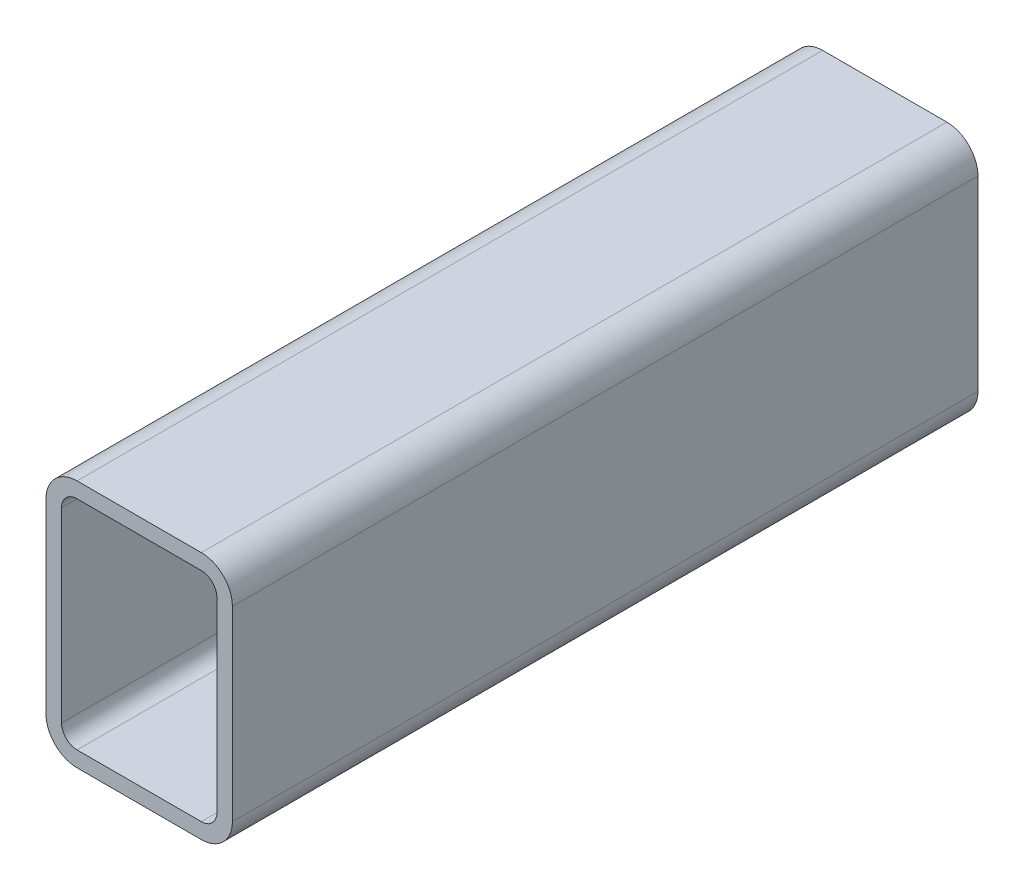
ISO-10303-21;
HEADER;
FILE_DESCRIPTION(('STEP AP214'),'2;1');
FILE_NAME('part.step','',(''),(''),'','','');
FILE_SCHEMA(('AUTOMOTIVE_DESIGN { 1 0 10303 214 1 1 1 1 }'));
ENDSEC;
DATA;
#1=APPLICATION_CONTEXT('core data for automotive mechanical design processes');
#2=APPLICATION_PROTOCOL_DEFINITION('international standard','automotive_design',2000,#1);
#3=PRODUCT_CONTEXT('',#1,'mechanical');
#4=PRODUCT('Part','Part','',(#3));
#5=PRODUCT_RELATED_PRODUCT_CATEGORY('part','',(#4));
#6=PRODUCT_DEFINITION_FORMATION('','',#4);
#7=PRODUCT_DEFINITION_CONTEXT('part definition',#1,'design');
#8=PRODUCT_DEFINITION('design','',#6,#7);
#9=PRODUCT_DEFINITION_SHAPE('','',#8);
#10=(LENGTH_UNIT() NAMED_UNIT(*) SI_UNIT(.MILLI.,.METRE.));
#11=(NAMED_UNIT(*) PLANE_ANGLE_UNIT() SI_UNIT($,.RADIAN.));
#12=(NAMED_UNIT(*) SI_UNIT($,.STERADIAN.) SOLID_ANGLE_UNIT());
#13=UNCERTAINTY_MEASURE_WITH_UNIT(LENGTH_MEASURE(1.E-05),#10,'distance_accuracy_value','');
#14=(GEOMETRIC_REPRESENTATION_CONTEXT(3) GLOBAL_UNCERTAINTY_ASSIGNED_CONTEXT((#13)) GLOBAL_UNIT_ASSIGNED_CONTEXT((#10,
#11,#12)) REPRESENTATION_CONTEXT('',''));
#15=CARTESIAN_POINT('',(0.,0.,0.));
#16=DIRECTION('',(0.,0.,1.));
#17=DIRECTION('',(1.,0.,0.));
#18=AXIS2_PLACEMENT_3D('',#15,#16,#17);
#19=CARTESIAN_POINT('',(15.1891160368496,90.9577651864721,304.8));
#20=DIRECTION('',(0.,0.,1.));
#21=DIRECTION('',(1.,0.,0.));
#22=AXIS2_PLACEMENT_3D('',#19,#20,#21);
#23=PLANE('',#22);
#24=CARTESIAN_POINT('',(15.1891160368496,90.9577651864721,304.8));
#25=DIRECTION('',(0.,0.,1.));
#26=DIRECTION('',(1.,0.,0.));
#27=AXIS2_PLACEMENT_3D('',#24,#25,#26);
#28=CIRCLE('',#27,12.7);
#29=CARTESIAN_POINT('',(15.1891160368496,103.657765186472,304.8));
#30=VERTEX_POINT('',#29);
#31=CARTESIAN_POINT('',(2.48911603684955,90.9577651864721,304.8));
#32=VERTEX_POINT('',#31);
#33=EDGE_CURVE('E211',#30,#32,#28,.T.);
#34=ORIENTED_EDGE('',*,*,#33,.T.);
#35=DIRECTION('',(0.,-1.,0.));
#36=VECTOR('',#35,1.);
#37=CARTESIAN_POINT('',(2.48911603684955,90.9577651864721,304.8));
#38=LINE('',#37,#36);
#39=CARTESIAN_POINT('',(2.48911603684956,14.7577651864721,304.8));
#40=VERTEX_POINT('',#39);
#41=EDGE_CURVE('E214',#32,#40,#38,.T.);
#42=ORIENTED_EDGE('',*,*,#41,.T.);
#43=CARTESIAN_POINT('',(15.1891160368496,14.7577651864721,304.8));
#44=DIRECTION('',(0.,0.,1.));
#45=DIRECTION('',(1.,0.,0.));
#46=AXIS2_PLACEMENT_3D('',#43,#44,#45);
#47=CIRCLE('',#46,12.7);
#48=CARTESIAN_POINT('',(15.1891160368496,2.05776518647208,304.8));
#49=VERTEX_POINT('',#48);
#50=EDGE_CURVE('E217',#40,#49,#47,.T.);
#51=ORIENTED_EDGE('',*,*,#50,.T.);
#52=DIRECTION('',(1.,0.,0.));
#53=VECTOR('',#52,1.);
#54=CARTESIAN_POINT('',(15.1891160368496,2.05776518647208,304.8));
#55=LINE('',#54,#53);
#56=CARTESIAN_POINT('',(65.9891160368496,2.05776518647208,304.8));
#57=VERTEX_POINT('',#56);
#58=EDGE_CURVE('E219',#49,#57,#55,.T.);
#59=ORIENTED_EDGE('',*,*,#58,.T.);
#60=CARTESIAN_POINT('',(65.9891160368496,14.7577651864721,304.8));
#61=DIRECTION('',(0.,0.,1.));
#62=DIRECTION('',(1.,0.,0.));
#63=AXIS2_PLACEMENT_3D('',#60,#61,#62);
#64=CIRCLE('',#63,12.7);
#65=CARTESIAN_POINT('',(78.6891160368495,14.7577651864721,304.8));
#66=VERTEX_POINT('',#65);
#67=EDGE_CURVE('E221',#57,#66,#64,.T.);
#68=ORIENTED_EDGE('',*,*,#67,.T.);
#69=DIRECTION('',(0.,1.,0.));
#70=VECTOR('',#69,1.);
#71=CARTESIAN_POINT('',(78.6891160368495,14.7577651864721,304.8));
#72=LINE('',#71,#70);
#73=CARTESIAN_POINT('',(78.6891160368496,90.9577651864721,304.8));
#74=VERTEX_POINT('',#73);
#75=EDGE_CURVE('E223',#66,#74,#72,.T.);
#76=ORIENTED_EDGE('',*,*,#75,.T.);
#77=CARTESIAN_POINT('',(65.9891160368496,90.9577651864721,304.8));
#78=DIRECTION('',(0.,0.,1.));
#79=DIRECTION('',(1.,0.,0.));
#80=AXIS2_PLACEMENT_3D('',#77,#78,#79);
#81=CIRCLE('',#80,12.7);
#82=CARTESIAN_POINT('',(65.9891160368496,103.657765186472,304.8));
#83=VERTEX_POINT('',#82);
#84=EDGE_CURVE('E225',#74,#83,#81,.T.);
#85=ORIENTED_EDGE('',*,*,#84,.T.);
#86=DIRECTION('',(-1.,0.,0.));
#87=VECTOR('',#86,1.);
#88=CARTESIAN_POINT('',(65.9891160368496,103.657765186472,304.8));
#89=LINE('',#88,#87);
#90=EDGE_CURVE('E227',#83,#30,#89,.T.);
#91=ORIENTED_EDGE('',*,*,#90,.T.);
#92=EDGE_LOOP('',(#34,#42,#51,#59,#68,#76,#85,#91));
#93=FACE_BOUND('',#92,.T.);
#94=DIRECTION('',(0.,-1.,0.));
#95=VECTOR('',#94,1.);
#96=CARTESIAN_POINT('',(8.83911603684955,14.7577651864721,304.8));
#97=LINE('',#96,#95);
#98=CARTESIAN_POINT('',(8.83911603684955,90.9577651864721,304.8));
#99=VERTEX_POINT('',#98);
#100=CARTESIAN_POINT('',(8.83911603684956,14.7577651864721,304.8));
#101=VERTEX_POINT('',#100);
#102=EDGE_CURVE('E154',#99,#101,#97,.T.);
#103=ORIENTED_EDGE('',*,*,#102,.F.);
#104=CARTESIAN_POINT('',(15.1891160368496,90.9577651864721,304.8));
#105=DIRECTION('',(0.,0.,1.));
#106=DIRECTION('',(1.,0.,0.));
#107=AXIS2_PLACEMENT_3D('',#104,#105,#106);
#108=CIRCLE('',#107,6.35000000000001);
#109=CARTESIAN_POINT('',(15.1891160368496,97.3077651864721,304.8));
#110=VERTEX_POINT('',#109);
#111=EDGE_CURVE('E146',#110,#99,#108,.T.);
#112=ORIENTED_EDGE('',*,*,#111,.F.);
#113=DIRECTION('',(-1.,0.,0.));
#114=VECTOR('',#113,1.);
#115=CARTESIAN_POINT('',(15.1891160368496,97.3077651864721,304.8));
#116=LINE('',#115,#114);
#117=CARTESIAN_POINT('',(65.9891160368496,97.3077651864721,304.8));
#118=VERTEX_POINT('',#117);
#119=EDGE_CURVE('E179',#118,#110,#116,.T.);
#120=ORIENTED_EDGE('',*,*,#119,.F.);
#121=CARTESIAN_POINT('',(65.9891160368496,90.9577651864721,304.8));
#122=DIRECTION('',(0.,0.,1.));
#123=DIRECTION('',(1.,0.,0.));
#124=AXIS2_PLACEMENT_3D('',#121,#122,#123);
#125=CIRCLE('',#124,6.35);
#126=CARTESIAN_POINT('',(72.3391160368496,90.9577651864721,304.8));
#127=VERTEX_POINT('',#126);
#128=EDGE_CURVE('E177',#127,#118,#125,.T.);
#129=ORIENTED_EDGE('',*,*,#128,.F.);
#130=DIRECTION('',(0.,1.,0.));
#131=VECTOR('',#130,1.);
#132=CARTESIAN_POINT('',(72.3391160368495,90.9577651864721,304.8));
#133=LINE('',#132,#131);
#134=CARTESIAN_POINT('',(72.3391160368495,14.7577651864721,304.8));
#135=VERTEX_POINT('',#134);
#136=EDGE_CURVE('E175',#135,#127,#133,.T.);
#137=ORIENTED_EDGE('',*,*,#136,.F.);
#138=CARTESIAN_POINT('',(65.9891160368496,14.7577651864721,304.8));
#139=DIRECTION('',(0.,0.,1.));
#140=DIRECTION('',(1.,0.,0.));
#141=AXIS2_PLACEMENT_3D('',#138,#139,#140);
#142=CIRCLE('',#141,6.35);
#143=CARTESIAN_POINT('',(65.9891160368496,8.40776518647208,304.8));
#144=VERTEX_POINT('',#143);
#145=EDGE_CURVE('E173',#144,#135,#142,.T.);
#146=ORIENTED_EDGE('',*,*,#145,.F.);
#147=DIRECTION('',(1.,0.,0.));
#148=VECTOR('',#147,1.);
#149=CARTESIAN_POINT('',(65.9891160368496,8.40776518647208,304.8));
#150=LINE('',#149,#148);
#151=CARTESIAN_POINT('',(15.1891160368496,8.40776518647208,304.8));
#152=VERTEX_POINT('',#151);
#153=EDGE_CURVE('E169',#152,#144,#150,.T.);
#154=ORIENTED_EDGE('',*,*,#153,.F.);
#155=CARTESIAN_POINT('',(15.1891160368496,14.7577651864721,304.8));
#156=DIRECTION('',(0.,0.,1.));
#157=DIRECTION('',(1.,0.,0.));
#158=AXIS2_PLACEMENT_3D('',#155,#156,#157);
#159=CIRCLE('',#158,6.35);
#160=EDGE_CURVE('E167',#101,#152,#159,.T.);
#161=ORIENTED_EDGE('',*,*,#160,.F.);
#162=EDGE_LOOP('',(#103,#112,#120,#129,#137,#146,#154,#161));
#163=FACE_BOUND('',#162,.T.);
#164=ADVANCED_FACE('F33',(#93,#163),#23,.T.);
#165=CARTESIAN_POINT('',(15.1891160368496,90.9577651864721,0.));
#166=DIRECTION('',(0.,0.,1.));
#167=DIRECTION('',(1.,0.,0.));
#168=AXIS2_PLACEMENT_3D('',#165,#166,#167);
#169=PLANE('',#168);
#170=CARTESIAN_POINT('',(15.1891160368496,90.9577651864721,0.));
#171=DIRECTION('',(0.,0.,1.));
#172=DIRECTION('',(1.,0.,0.));
#173=AXIS2_PLACEMENT_3D('',#170,#171,#172);
#174=CIRCLE('',#173,12.7);
#175=CARTESIAN_POINT('',(15.1891160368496,103.657765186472,0.));
#176=VERTEX_POINT('',#175);
#177=CARTESIAN_POINT('',(2.48911603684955,90.9577651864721,0.));
#178=VERTEX_POINT('',#177);
#179=EDGE_CURVE('E162',#176,#178,#174,.T.);
#180=ORIENTED_EDGE('',*,*,#179,.F.);
#181=DIRECTION('',(-1.,0.,0.));
#182=VECTOR('',#181,1.);
#183=CARTESIAN_POINT('',(65.9891160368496,103.657765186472,0.));
#184=LINE('',#183,#182);
#185=CARTESIAN_POINT('',(65.9891160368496,103.657765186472,0.));
#186=VERTEX_POINT('',#185);
#187=EDGE_CURVE('E215',#186,#176,#184,.T.);
#188=ORIENTED_EDGE('',*,*,#187,.F.);
#189=CARTESIAN_POINT('',(65.9891160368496,90.9577651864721,0.));
#190=DIRECTION('',(0.,0.,1.));
#191=DIRECTION('',(1.,0.,0.));
#192=AXIS2_PLACEMENT_3D('',#189,#190,#191);
#193=CIRCLE('',#192,12.7);
#194=CARTESIAN_POINT('',(78.6891160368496,90.9577651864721,0.));
#195=VERTEX_POINT('',#194);
#196=EDGE_CURVE('E242',#195,#186,#193,.T.);
#197=ORIENTED_EDGE('',*,*,#196,.F.);
#198=DIRECTION('',(0.,1.,0.));
#199=VECTOR('',#198,1.);
#200=CARTESIAN_POINT('',(78.6891160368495,14.7577651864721,0.));
#201=LINE('',#200,#199);
#202=CARTESIAN_POINT('',(78.6891160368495,14.7577651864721,0.));
#203=VERTEX_POINT('',#202);
#204=EDGE_CURVE('E240',#203,#195,#201,.T.);
#205=ORIENTED_EDGE('',*,*,#204,.F.);
#206=CARTESIAN_POINT('',(65.9891160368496,14.7577651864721,0.));
#207=DIRECTION('',(0.,0.,1.));
#208=DIRECTION('',(1.,0.,0.));
#209=AXIS2_PLACEMENT_3D('',#206,#207,#208);
#210=CIRCLE('',#209,12.7);
#211=CARTESIAN_POINT('',(65.9891160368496,2.05776518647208,0.));
#212=VERTEX_POINT('',#211);
#213=EDGE_CURVE('E238',#212,#203,#210,.T.);
#214=ORIENTED_EDGE('',*,*,#213,.F.);
#215=DIRECTION('',(1.,0.,0.));
#216=VECTOR('',#215,1.);
#217=CARTESIAN_POINT('',(15.1891160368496,2.05776518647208,0.));
#218=LINE('',#217,#216);
#219=CARTESIAN_POINT('',(15.1891160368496,2.05776518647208,0.));
#220=VERTEX_POINT('',#219);
#221=EDGE_CURVE('E236',#220,#212,#218,.T.);
#222=ORIENTED_EDGE('',*,*,#221,.F.);
#223=CARTESIAN_POINT('',(15.1891160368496,14.7577651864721,0.));
#224=DIRECTION('',(0.,0.,1.));
#225=DIRECTION('',(1.,0.,0.));
#226=AXIS2_PLACEMENT_3D('',#223,#224,#225);
#227=CIRCLE('',#226,12.7);
#228=CARTESIAN_POINT('',(2.48911603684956,14.7577651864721,0.));
#229=VERTEX_POINT('',#228);
#230=EDGE_CURVE('E234',#229,#220,#227,.T.);
#231=ORIENTED_EDGE('',*,*,#230,.F.);
#232=DIRECTION('',(0.,-1.,0.));
#233=VECTOR('',#232,1.);
#234=CARTESIAN_POINT('',(2.48911603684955,90.9577651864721,0.));
#235=LINE('',#234,#233);
#236=EDGE_CURVE('E232',#178,#229,#235,.T.);
#237=ORIENTED_EDGE('',*,*,#236,.F.);
#238=EDGE_LOOP('',(#180,#188,#197,#205,#214,#222,#231,#237));
#239=FACE_BOUND('',#238,.T.);
#240=CARTESIAN_POINT('',(15.1891160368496,90.9577651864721,0.));
#241=DIRECTION('',(0.,0.,1.));
#242=DIRECTION('',(1.,0.,0.));
#243=AXIS2_PLACEMENT_3D('',#240,#241,#242);
#244=CIRCLE('',#243,6.35000000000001);
#245=CARTESIAN_POINT('',(15.1891160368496,97.3077651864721,0.));
#246=VERTEX_POINT('',#245);
#247=CARTESIAN_POINT('',(8.83911603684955,90.9577651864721,0.));
#248=VERTEX_POINT('',#247);
#249=EDGE_CURVE('E56',#246,#248,#244,.T.);
#250=ORIENTED_EDGE('',*,*,#249,.T.);
#251=DIRECTION('',(0.,-1.,0.));
#252=VECTOR('',#251,1.);
#253=CARTESIAN_POINT('',(8.83911603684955,14.7577651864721,0.));
#254=LINE('',#253,#252);
#255=CARTESIAN_POINT('',(8.83911603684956,14.7577651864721,0.));
#256=VERTEX_POINT('',#255);
#257=EDGE_CURVE('E161',#248,#256,#254,.T.);
#258=ORIENTED_EDGE('',*,*,#257,.T.);
#259=CARTESIAN_POINT('',(15.1891160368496,14.7577651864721,0.));
#260=DIRECTION('',(0.,0.,1.));
#261=DIRECTION('',(1.,0.,0.));
#262=AXIS2_PLACEMENT_3D('',#259,#260,#261);
#263=CIRCLE('',#262,6.35);
#264=CARTESIAN_POINT('',(15.1891160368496,8.40776518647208,0.));
#265=VERTEX_POINT('',#264);
#266=EDGE_CURVE('E183',#256,#265,#263,.T.);
#267=ORIENTED_EDGE('',*,*,#266,.T.);
#268=DIRECTION('',(1.,0.,0.));
#269=VECTOR('',#268,1.);
#270=CARTESIAN_POINT('',(65.9891160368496,8.40776518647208,0.));
#271=LINE('',#270,#269);
#272=CARTESIAN_POINT('',(65.9891160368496,8.40776518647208,0.));
#273=VERTEX_POINT('',#272);
#274=EDGE_CURVE('E186',#265,#273,#271,.T.);
#275=ORIENTED_EDGE('',*,*,#274,.T.);
#276=CARTESIAN_POINT('',(65.9891160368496,14.7577651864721,0.));
#277=DIRECTION('',(0.,0.,1.));
#278=DIRECTION('',(1.,0.,0.));
#279=AXIS2_PLACEMENT_3D('',#276,#277,#278);
#280=CIRCLE('',#279,6.35);
#281=CARTESIAN_POINT('',(72.3391160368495,14.7577651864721,0.));
#282=VERTEX_POINT('',#281);
#283=EDGE_CURVE('E189',#273,#282,#280,.T.);
#284=ORIENTED_EDGE('',*,*,#283,.T.);
#285=DIRECTION('',(0.,1.,0.));
#286=VECTOR('',#285,1.);
#287=CARTESIAN_POINT('',(72.3391160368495,90.9577651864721,0.));
#288=LINE('',#287,#286);
#289=CARTESIAN_POINT('',(72.3391160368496,90.9577651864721,0.));
#290=VERTEX_POINT('',#289);
#291=EDGE_CURVE('E192',#282,#290,#288,.T.);
#292=ORIENTED_EDGE('',*,*,#291,.T.);
#293=CARTESIAN_POINT('',(65.9891160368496,90.9577651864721,0.));
#294=DIRECTION('',(0.,0.,1.));
#295=DIRECTION('',(1.,0.,0.));
#296=AXIS2_PLACEMENT_3D('',#293,#294,#295);
#297=CIRCLE('',#296,6.35);
#298=CARTESIAN_POINT('',(65.9891160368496,97.3077651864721,0.));
#299=VERTEX_POINT('',#298);
#300=EDGE_CURVE('E195',#290,#299,#297,.T.);
#301=ORIENTED_EDGE('',*,*,#300,.T.);
#302=DIRECTION('',(-1.,0.,0.));
#303=VECTOR('',#302,1.);
#304=CARTESIAN_POINT('',(15.1891160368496,97.3077651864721,0.));
#305=LINE('',#304,#303);
#306=EDGE_CURVE('E155',#299,#246,#305,.T.);
#307=ORIENTED_EDGE('',*,*,#306,.T.);
#308=EDGE_LOOP('',(#250,#258,#267,#275,#284,#292,#301,#307));
#309=FACE_BOUND('',#308,.T.);
#310=ADVANCED_FACE('F272',(#239,#309),#169,.F.);
#311=CARTESIAN_POINT('',(15.1891160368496,90.9577651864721,304.8));
#312=DIRECTION('',(0.,0.,-1.));
#313=DIRECTION('',(-1.,0.,0.));
#314=AXIS2_PLACEMENT_3D('',#311,#312,#313);
#315=CYLINDRICAL_SURFACE('',#314,12.7);
#316=ORIENTED_EDGE('',*,*,#179,.T.);
#317=DIRECTION('',(0.,0.,-1.));
#318=VECTOR('',#317,1.);
#319=CARTESIAN_POINT('',(2.48911603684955,90.9577651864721,304.8));
#320=LINE('',#319,#318);
#321=EDGE_CURVE('E11',#32,#178,#320,.T.);
#322=ORIENTED_EDGE('',*,*,#321,.F.);
#323=ORIENTED_EDGE('',*,*,#33,.F.);
#324=DIRECTION('',(0.,0.,-1.));
#325=VECTOR('',#324,1.);
#326=CARTESIAN_POINT('',(15.1891160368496,103.657765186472,304.8));
#327=LINE('',#326,#325);
#328=EDGE_CURVE('E229',#30,#176,#327,.T.);
#329=ORIENTED_EDGE('',*,*,#328,.T.);
#330=EDGE_LOOP('',(#316,#322,#323,#329));
#331=FACE_BOUND('',#330,.T.);
#332=ADVANCED_FACE('F35',(#331),#315,.T.);
#333=CARTESIAN_POINT('',(2.48911603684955,90.9577651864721,304.8));
#334=DIRECTION('',(1.,0.,0.));
#335=DIRECTION('',(0.,0.,-1.));
#336=AXIS2_PLACEMENT_3D('',#333,#334,#335);
#337=PLANE('',#336);
#338=ORIENTED_EDGE('',*,*,#236,.T.);
#339=DIRECTION('',(0.,0.,-1.));
#340=VECTOR('',#339,1.);
#341=CARTESIAN_POINT('',(2.48911603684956,14.7577651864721,304.8));
#342=LINE('',#341,#340);
#343=EDGE_CURVE('E41',#40,#229,#342,.T.);
#344=ORIENTED_EDGE('',*,*,#343,.F.);
#345=ORIENTED_EDGE('',*,*,#41,.F.);
#346=ORIENTED_EDGE('',*,*,#321,.T.);
#347=EDGE_LOOP('',(#338,#344,#345,#346));
#348=FACE_BOUND('',#347,.T.);
#349=ADVANCED_FACE('F289',(#348),#337,.F.);
#350=CARTESIAN_POINT('',(15.1891160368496,14.7577651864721,304.8));
#351=DIRECTION('',(0.,0.,-1.));
#352=DIRECTION('',(-1.,0.,0.));
#353=AXIS2_PLACEMENT_3D('',#350,#351,#352);
#354=CYLINDRICAL_SURFACE('',#353,12.7);
#355=ORIENTED_EDGE('',*,*,#230,.T.);
#356=DIRECTION('',(0.,0.,-1.));
#357=VECTOR('',#356,1.);
#358=CARTESIAN_POINT('',(15.1891160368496,2.05776518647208,304.8));
#359=LINE('',#358,#357);
#360=EDGE_CURVE('E259',#49,#220,#359,.T.);
#361=ORIENTED_EDGE('',*,*,#360,.F.);
#362=ORIENTED_EDGE('',*,*,#50,.F.);
#363=ORIENTED_EDGE('',*,*,#343,.T.);
#364=EDGE_LOOP('',(#355,#361,#362,#363));
#365=FACE_BOUND('',#364,.T.);
#366=ADVANCED_FACE('F266',(#365),#354,.T.);
#367=CARTESIAN_POINT('',(15.1891160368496,2.05776518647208,304.8));
#368=DIRECTION('',(0.,1.,0.));
#369=DIRECTION('',(0.,0.,1.));
#370=AXIS2_PLACEMENT_3D('',#367,#368,#369);
#371=PLANE('',#370);
#372=ORIENTED_EDGE('',*,*,#221,.T.);
#373=DIRECTION('',(0.,0.,-1.));
#374=VECTOR('',#373,1.);
#375=CARTESIAN_POINT('',(65.9891160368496,2.05776518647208,304.8));
#376=LINE('',#375,#374);
#377=EDGE_CURVE('E256',#57,#212,#376,.T.);
#378=ORIENTED_EDGE('',*,*,#377,.F.);
#379=ORIENTED_EDGE('',*,*,#58,.F.);
#380=ORIENTED_EDGE('',*,*,#360,.T.);
#381=EDGE_LOOP('',(#372,#378,#379,#380));
#382=FACE_BOUND('',#381,.T.);
#383=ADVANCED_FACE('F278',(#382),#371,.F.);
#384=CARTESIAN_POINT('',(65.9891160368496,14.7577651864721,304.8));
#385=DIRECTION('',(0.,0.,-1.));
#386=DIRECTION('',(-1.,0.,0.));
#387=AXIS2_PLACEMENT_3D('',#384,#385,#386);
#388=CYLINDRICAL_SURFACE('',#387,12.7);
#389=ORIENTED_EDGE('',*,*,#213,.T.);
#390=DIRECTION('',(0.,0.,-1.));
#391=VECTOR('',#390,1.);
#392=CARTESIAN_POINT('',(78.6891160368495,14.7577651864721,304.8));
#393=LINE('',#392,#391);
#394=EDGE_CURVE('E253',#66,#203,#393,.T.);
#395=ORIENTED_EDGE('',*,*,#394,.F.);
#396=ORIENTED_EDGE('',*,*,#67,.F.);
#397=ORIENTED_EDGE('',*,*,#377,.T.);
#398=EDGE_LOOP('',(#389,#395,#396,#397));
#399=FACE_BOUND('',#398,.T.);
#400=ADVANCED_FACE('F282',(#399),#388,.T.);
#401=CARTESIAN_POINT('',(78.6891160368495,14.7577651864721,304.8));
#402=DIRECTION('',(-1.,0.,0.));
#403=DIRECTION('',(0.,0.,1.));
#404=AXIS2_PLACEMENT_3D('',#401,#402,#403);
#405=PLANE('',#404);
#406=ORIENTED_EDGE('',*,*,#204,.T.);
#407=DIRECTION('',(0.,0.,-1.));
#408=VECTOR('',#407,1.);
#409=CARTESIAN_POINT('',(78.6891160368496,90.9577651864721,304.8));
#410=LINE('',#409,#408);
#411=EDGE_CURVE('E250',#74,#195,#410,.T.);
#412=ORIENTED_EDGE('',*,*,#411,.F.);
#413=ORIENTED_EDGE('',*,*,#75,.F.);
#414=ORIENTED_EDGE('',*,*,#394,.T.);
#415=EDGE_LOOP('',(#406,#412,#413,#414));
#416=FACE_BOUND('',#415,.T.);
#417=ADVANCED_FACE('F302',(#416),#405,.F.);
#418=CARTESIAN_POINT('',(65.9891160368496,90.9577651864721,304.8));
#419=DIRECTION('',(0.,0.,-1.));
#420=DIRECTION('',(-1.,0.,0.));
#421=AXIS2_PLACEMENT_3D('',#418,#419,#420);
#422=CYLINDRICAL_SURFACE('',#421,12.7);
#423=ORIENTED_EDGE('',*,*,#196,.T.);
#424=DIRECTION('',(0.,0.,-1.));
#425=VECTOR('',#424,1.);
#426=CARTESIAN_POINT('',(65.9891160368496,103.657765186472,304.8));
#427=LINE('',#426,#425);
#428=EDGE_CURVE('E247',#83,#186,#427,.T.);
#429=ORIENTED_EDGE('',*,*,#428,.F.);
#430=ORIENTED_EDGE('',*,*,#84,.F.);
#431=ORIENTED_EDGE('',*,*,#411,.T.);
#432=EDGE_LOOP('',(#423,#429,#430,#431));
#433=FACE_BOUND('',#432,.T.);
#434=ADVANCED_FACE('F300',(#433),#422,.T.);
#435=CARTESIAN_POINT('',(65.9891160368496,103.657765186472,304.8));
#436=DIRECTION('',(0.,-1.,0.));
#437=DIRECTION('',(0.,0.,-1.));
#438=AXIS2_PLACEMENT_3D('',#435,#436,#437);
#439=PLANE('',#438);
#440=ORIENTED_EDGE('',*,*,#187,.T.);
#441=ORIENTED_EDGE('',*,*,#328,.F.);
#442=ORIENTED_EDGE('',*,*,#90,.F.);
#443=ORIENTED_EDGE('',*,*,#428,.T.);
#444=EDGE_LOOP('',(#440,#441,#442,#443));
#445=FACE_BOUND('',#444,.T.);
#446=ADVANCED_FACE('F295',(#445),#439,.F.);
#447=CARTESIAN_POINT('',(15.1891160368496,90.9577651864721,304.8));
#448=DIRECTION('',(0.,0.,-1.));
#449=DIRECTION('',(-1.,0.,0.));
#450=AXIS2_PLACEMENT_3D('',#447,#448,#449);
#451=CYLINDRICAL_SURFACE('',#450,6.35000000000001);
#452=ORIENTED_EDGE('',*,*,#249,.F.);
#453=DIRECTION('',(0.,0.,-1.));
#454=VECTOR('',#453,1.);
#455=CARTESIAN_POINT('',(15.1891160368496,97.3077651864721,304.8));
#456=LINE('',#455,#454);
#457=EDGE_CURVE('E150',#110,#246,#456,.T.);
#458=ORIENTED_EDGE('',*,*,#457,.F.);
#459=ORIENTED_EDGE('',*,*,#111,.T.);
#460=DIRECTION('',(0.,0.,-1.));
#461=VECTOR('',#460,1.);
#462=CARTESIAN_POINT('',(8.83911603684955,90.9577651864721,304.8));
#463=LINE('',#462,#461);
#464=EDGE_CURVE('E149',#99,#248,#463,.T.);
#465=ORIENTED_EDGE('',*,*,#464,.T.);
#466=EDGE_LOOP('',(#452,#458,#459,#465));
#467=FACE_BOUND('',#466,.T.);
#468=ADVANCED_FACE('F148',(#467),#451,.F.);
#469=CARTESIAN_POINT('',(8.83911603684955,14.7577651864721,304.8));
#470=DIRECTION('',(1.,0.,0.));
#471=DIRECTION('',(0.,0.,-1.));
#472=AXIS2_PLACEMENT_3D('',#469,#470,#471);
#473=PLANE('',#472);
#474=ORIENTED_EDGE('',*,*,#257,.F.);
#475=ORIENTED_EDGE('',*,*,#464,.F.);
#476=ORIENTED_EDGE('',*,*,#102,.T.);
#477=DIRECTION('',(0.,0.,-1.));
#478=VECTOR('',#477,1.);
#479=CARTESIAN_POINT('',(8.83911603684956,14.7577651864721,304.8));
#480=LINE('',#479,#478);
#481=EDGE_CURVE('E163',#101,#256,#480,.T.);
#482=ORIENTED_EDGE('',*,*,#481,.T.);
#483=EDGE_LOOP('',(#474,#475,#476,#482));
#484=FACE_BOUND('',#483,.T.);
#485=ADVANCED_FACE('F158',(#484),#473,.T.);
#486=CARTESIAN_POINT('',(15.1891160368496,14.7577651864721,304.8));
#487=DIRECTION('',(0.,0.,-1.));
#488=DIRECTION('',(-1.,0.,0.));
#489=AXIS2_PLACEMENT_3D('',#486,#487,#488);
#490=CYLINDRICAL_SURFACE('',#489,6.35);
#491=ORIENTED_EDGE('',*,*,#266,.F.);
#492=ORIENTED_EDGE('',*,*,#481,.F.);
#493=ORIENTED_EDGE('',*,*,#160,.T.);
#494=DIRECTION('',(0.,0.,-1.));
#495=VECTOR('',#494,1.);
#496=CARTESIAN_POINT('',(15.1891160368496,8.40776518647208,304.8));
#497=LINE('',#496,#495);
#498=EDGE_CURVE('E208',#152,#265,#497,.T.);
#499=ORIENTED_EDGE('',*,*,#498,.T.);
#500=EDGE_LOOP('',(#491,#492,#493,#499));
#501=FACE_BOUND('',#500,.T.);
#502=ADVANCED_FACE('F327',(#501),#490,.F.);
#503=CARTESIAN_POINT('',(65.9891160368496,8.40776518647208,304.8));
#504=DIRECTION('',(0.,1.,0.));
#505=DIRECTION('',(0.,0.,1.));
#506=AXIS2_PLACEMENT_3D('',#503,#504,#505);
#507=PLANE('',#506);
#508=ORIENTED_EDGE('',*,*,#274,.F.);
#509=ORIENTED_EDGE('',*,*,#498,.F.);
#510=ORIENTED_EDGE('',*,*,#153,.T.);
#511=DIRECTION('',(0.,0.,-1.));
#512=VECTOR('',#511,1.);
#513=CARTESIAN_POINT('',(65.9891160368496,8.40776518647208,304.8));
#514=LINE('',#513,#512);
#515=EDGE_CURVE('E206',#144,#273,#514,.T.);
#516=ORIENTED_EDGE('',*,*,#515,.T.);
#517=EDGE_LOOP('',(#508,#509,#510,#516));
#518=FACE_BOUND('',#517,.T.);
#519=ADVANCED_FACE('F331',(#518),#507,.T.);
#520=CARTESIAN_POINT('',(65.9891160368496,14.7577651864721,304.8));
#521=DIRECTION('',(0.,0.,-1.));
#522=DIRECTION('',(-1.,0.,0.));
#523=AXIS2_PLACEMENT_3D('',#520,#521,#522);
#524=CYLINDRICAL_SURFACE('',#523,6.35);
#525=ORIENTED_EDGE('',*,*,#283,.F.);
#526=ORIENTED_EDGE('',*,*,#515,.F.);
#527=ORIENTED_EDGE('',*,*,#145,.T.);
#528=DIRECTION('',(0.,0.,-1.));
#529=VECTOR('',#528,1.);
#530=CARTESIAN_POINT('',(72.3391160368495,14.7577651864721,304.8));
#531=LINE('',#530,#529);
#532=EDGE_CURVE('E204',#135,#282,#531,.T.);
#533=ORIENTED_EDGE('',*,*,#532,.T.);
#534=EDGE_LOOP('',(#525,#526,#527,#533));
#535=FACE_BOUND('',#534,.T.);
#536=ADVANCED_FACE('F337',(#535),#524,.F.);
#537=CARTESIAN_POINT('',(72.3391160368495,90.9577651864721,304.8));
#538=DIRECTION('',(-1.,0.,0.));
#539=DIRECTION('',(0.,0.,1.));
#540=AXIS2_PLACEMENT_3D('',#537,#538,#539);
#541=PLANE('',#540);
#542=ORIENTED_EDGE('',*,*,#291,.F.);
#543=ORIENTED_EDGE('',*,*,#532,.F.);
#544=ORIENTED_EDGE('',*,*,#136,.T.);
#545=DIRECTION('',(0.,0.,-1.));
#546=VECTOR('',#545,1.);
#547=CARTESIAN_POINT('',(72.3391160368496,90.9577651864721,304.8));
#548=LINE('',#547,#546);
#549=EDGE_CURVE('E202',#127,#290,#548,.T.);
#550=ORIENTED_EDGE('',*,*,#549,.T.);
#551=EDGE_LOOP('',(#542,#543,#544,#550));
#552=FACE_BOUND('',#551,.T.);
#553=ADVANCED_FACE('F341',(#552),#541,.T.);
#554=CARTESIAN_POINT('',(65.9891160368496,90.9577651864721,304.8));
#555=DIRECTION('',(0.,0.,-1.));
#556=DIRECTION('',(-1.,0.,0.));
#557=AXIS2_PLACEMENT_3D('',#554,#555,#556);
#558=CYLINDRICAL_SURFACE('',#557,6.35);
#559=ORIENTED_EDGE('',*,*,#300,.F.);
#560=ORIENTED_EDGE('',*,*,#549,.F.);
#561=ORIENTED_EDGE('',*,*,#128,.T.);
#562=DIRECTION('',(0.,0.,-1.));
#563=VECTOR('',#562,1.);
#564=CARTESIAN_POINT('',(65.9891160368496,97.3077651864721,304.8));
#565=LINE('',#564,#563);
#566=EDGE_CURVE('E48',#118,#299,#565,.T.);
#567=ORIENTED_EDGE('',*,*,#566,.T.);
#568=EDGE_LOOP('',(#559,#560,#561,#567));
#569=FACE_BOUND('',#568,.T.);
#570=ADVANCED_FACE('F345',(#569),#558,.F.);
#571=CARTESIAN_POINT('',(15.1891160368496,97.3077651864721,304.8));
#572=DIRECTION('',(0.,-1.,0.));
#573=DIRECTION('',(0.,0.,-1.));
#574=AXIS2_PLACEMENT_3D('',#571,#572,#573);
#575=PLANE('',#574);
#576=ORIENTED_EDGE('',*,*,#306,.F.);
#577=ORIENTED_EDGE('',*,*,#566,.F.);
#578=ORIENTED_EDGE('',*,*,#119,.T.);
#579=ORIENTED_EDGE('',*,*,#457,.T.);
#580=EDGE_LOOP('',(#576,#577,#578,#579));
#581=FACE_BOUND('',#580,.T.);
#582=ADVANCED_FACE('F349',(#581),#575,.T.);
#583=CLOSED_SHELL('',(#164,#310,#332,#349,#366,#383,#400,#417,#434,#446,#468,#485,#502,#519,
#536,#553,#570,#582));
#584=MANIFOLD_SOLID_BREP('B2',#583);
#585=ADVANCED_BREP_SHAPE_REPRESENTATION('',(#18,#584),#14);
#586=SHAPE_DEFINITION_REPRESENTATION(#9,#585);
ENDSEC;
END-ISO-10303-21;
